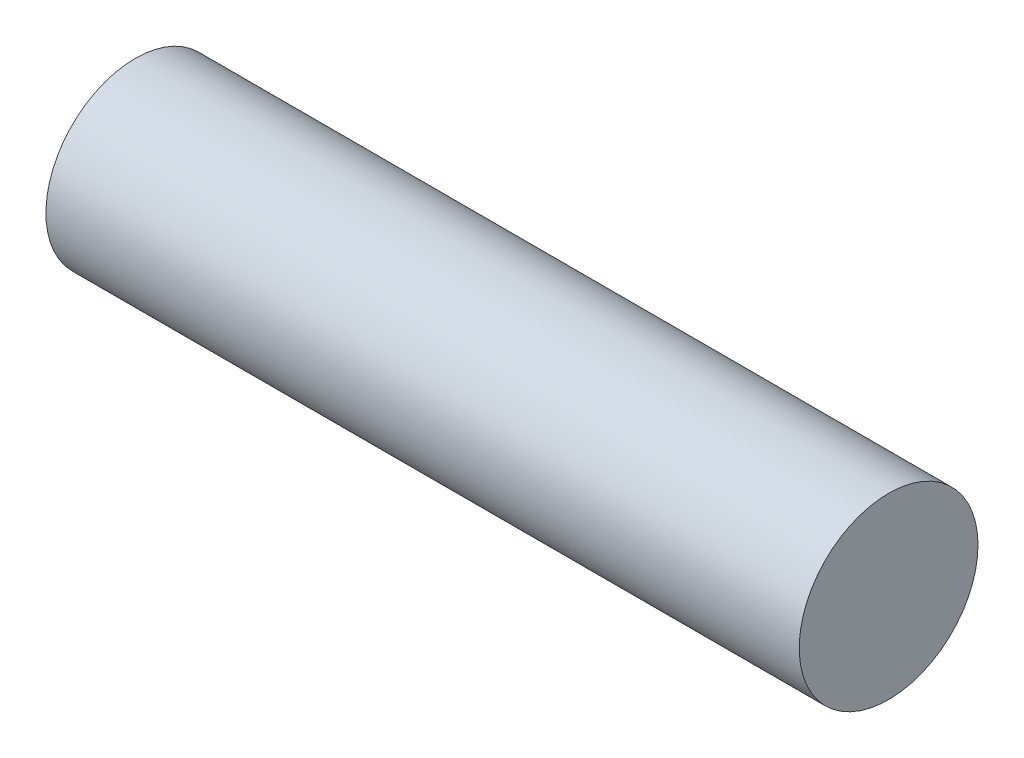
from build123d import *


with BuildPart() as part:
    # Skizze1 → Rotation1 (revolve)
    with BuildSketch(Plane.XY, mode=Mode.PRIVATE) as rotation1_sk:
        with BuildLine():
            Line((12.445, 1.25), (12.445, 0))
            Line((12.445, 0), (2.26, 0))
            ThreePointArc((2.26, 0), (2.170784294, 0.64907088), (1.909754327, 1.25))
            Line((1.909754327, 1.25), (12.445, 1.25))
        make_face()
    revolve(rotation1_sk.sketch.rotate(Axis((0, 0, 0), (-1, 0, 0)), 90), axis=Axis((0, 0, 0), (-1, 0, 0)))


solid = part.part
